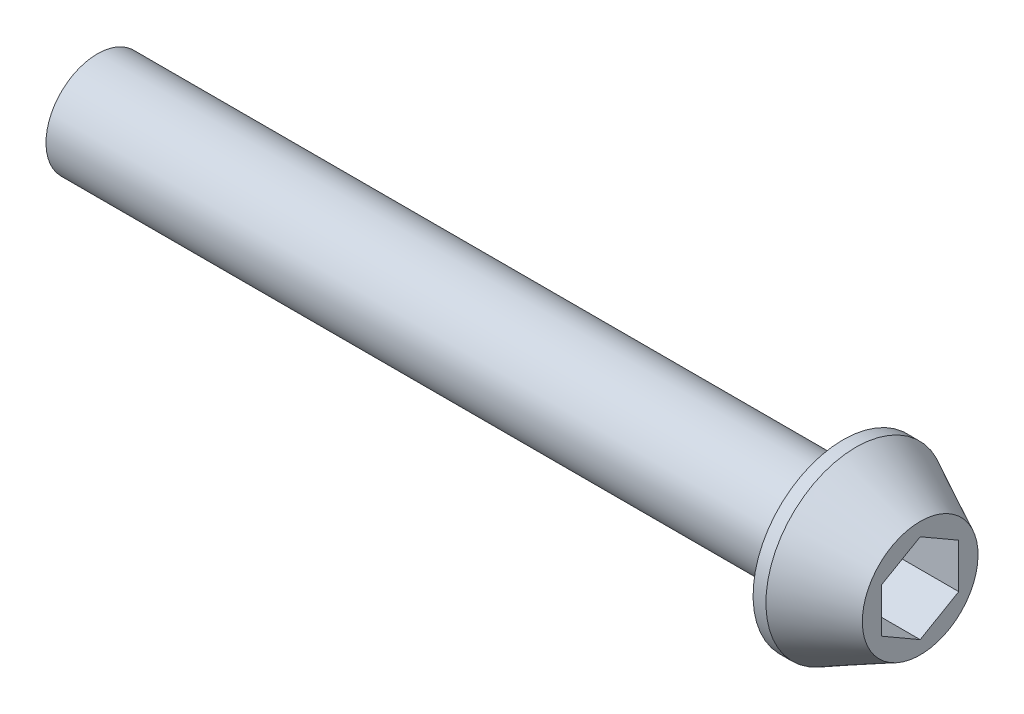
ISO-10303-21;
HEADER;
FILE_DESCRIPTION(('STEP AP214'),'2;1');
FILE_NAME('part.step','',(''),(''),'','','');
FILE_SCHEMA(('AUTOMOTIVE_DESIGN { 1 0 10303 214 1 1 1 1 }'));
ENDSEC;
DATA;
#1=APPLICATION_CONTEXT('core data for automotive mechanical design processes');
#2=APPLICATION_PROTOCOL_DEFINITION('international standard','automotive_design',2000,#1);
#3=PRODUCT_CONTEXT('',#1,'mechanical');
#4=PRODUCT('Part','Part','',(#3));
#5=PRODUCT_RELATED_PRODUCT_CATEGORY('part','',(#4));
#6=PRODUCT_DEFINITION_FORMATION('','',#4);
#7=PRODUCT_DEFINITION_CONTEXT('part definition',#1,'design');
#8=PRODUCT_DEFINITION('design','',#6,#7);
#9=PRODUCT_DEFINITION_SHAPE('','',#8);
#10=(LENGTH_UNIT() NAMED_UNIT(*) SI_UNIT(.MILLI.,.METRE.));
#11=(NAMED_UNIT(*) PLANE_ANGLE_UNIT() SI_UNIT($,.RADIAN.));
#12=(NAMED_UNIT(*) SI_UNIT($,.STERADIAN.) SOLID_ANGLE_UNIT());
#13=UNCERTAINTY_MEASURE_WITH_UNIT(LENGTH_MEASURE(1.E-05),#10,'distance_accuracy_value','');
#14=(GEOMETRIC_REPRESENTATION_CONTEXT(3) GLOBAL_UNCERTAINTY_ASSIGNED_CONTEXT((#13)) GLOBAL_UNIT_ASSIGNED_CONTEXT((#10,
#11,#12)) REPRESENTATION_CONTEXT('',''));
#15=CARTESIAN_POINT('',(0.,0.,0.));
#16=DIRECTION('',(0.,0.,1.));
#17=DIRECTION('',(1.,0.,0.));
#18=AXIS2_PLACEMENT_3D('',#15,#16,#17);
#19=CARTESIAN_POINT('',(-6.,3.,0.));
#20=DIRECTION('',(-1.,0.,0.));
#21=DIRECTION('',(0.,-1.,0.));
#22=AXIS2_PLACEMENT_3D('',#19,#20,#21);
#23=PLANE('',#22);
#24=CARTESIAN_POINT('',(-6.,0.,0.));
#25=DIRECTION('',(1.,0.,0.));
#26=DIRECTION('',(0.,1.,0.));
#27=AXIS2_PLACEMENT_3D('',#24,#25,#26);
#28=CIRCLE('',#27,3.);
#29=CARTESIAN_POINT('',(-6.,3.,0.));
#30=VERTEX_POINT('',#29);
#31=EDGE_CURVE('E133',#30,#30,#28,.T.);
#32=ORIENTED_EDGE('',*,*,#31,.F.);
#33=EDGE_LOOP('',(#32));
#34=FACE_BOUND('',#33,.T.);
#35=ADVANCED_FACE('F32',(#34),#23,.T.);
#36=CARTESIAN_POINT('',(0.,4.5,0.));
#37=DIRECTION('',(1.,0.,0.));
#38=DIRECTION('',(0.,1.,0.));
#39=AXIS2_PLACEMENT_3D('',#36,#37,#38);
#40=PLANE('',#39);
#41=DIRECTION('',(0.,0.5,0.866025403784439));
#42=VECTOR('',#41,1.);
#43=CARTESIAN_POINT('',(0.,1.73205080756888,-3.));
#44=LINE('',#43,#42);
#45=CARTESIAN_POINT('',(0.,1.73205080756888,-3.));
#46=VERTEX_POINT('',#45);
#47=CARTESIAN_POINT('',(0.,3.46410161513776,0.));
#48=VERTEX_POINT('',#47);
#49=EDGE_CURVE('E46',#46,#48,#44,.T.);
#50=ORIENTED_EDGE('',*,*,#49,.F.);
#51=DIRECTION('',(0.,1.,0.));
#52=VECTOR('',#51,1.);
#53=CARTESIAN_POINT('',(0.,-1.73205080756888,-3.));
#54=LINE('',#53,#52);
#55=CARTESIAN_POINT('',(0.,-1.73205080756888,-3.));
#56=VERTEX_POINT('',#55);
#57=EDGE_CURVE('E129',#56,#46,#54,.T.);
#58=ORIENTED_EDGE('',*,*,#57,.F.);
#59=DIRECTION('',(0.,0.5,-0.866025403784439));
#60=VECTOR('',#59,1.);
#61=CARTESIAN_POINT('',(0.,-3.46410161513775,0.));
#62=LINE('',#61,#60);
#63=CARTESIAN_POINT('',(0.,-3.46410161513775,0.));
#64=VERTEX_POINT('',#63);
#65=EDGE_CURVE('E127',#64,#56,#62,.T.);
#66=ORIENTED_EDGE('',*,*,#65,.F.);
#67=DIRECTION('',(0.,-0.5,-0.866025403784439));
#68=VECTOR('',#67,1.);
#69=CARTESIAN_POINT('',(0.,-1.73205080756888,3.));
#70=LINE('',#69,#68);
#71=CARTESIAN_POINT('',(0.,-1.73205080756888,3.));
#72=VERTEX_POINT('',#71);
#73=EDGE_CURVE('E94',#72,#64,#70,.T.);
#74=ORIENTED_EDGE('',*,*,#73,.F.);
#75=DIRECTION('',(0.,-1.,0.));
#76=VECTOR('',#75,1.);
#77=CARTESIAN_POINT('',(0.,1.73205080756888,3.));
#78=LINE('',#77,#76);
#79=CARTESIAN_POINT('',(0.,1.73205080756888,3.));
#80=VERTEX_POINT('',#79);
#81=EDGE_CURVE('E123',#80,#72,#78,.T.);
#82=ORIENTED_EDGE('',*,*,#81,.F.);
#83=DIRECTION('',(0.,-0.5,0.866025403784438));
#84=VECTOR('',#83,1.);
#85=CARTESIAN_POINT('',(0.,3.46410161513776,0.));
#86=LINE('',#85,#84);
#87=EDGE_CURVE('E120',#48,#80,#86,.T.);
#88=ORIENTED_EDGE('',*,*,#87,.F.);
#89=EDGE_LOOP('',(#50,#58,#66,#74,#82,#88));
#90=FACE_BOUND('',#89,.T.);
#91=CARTESIAN_POINT('',(0.,0.,0.));
#92=DIRECTION('',(1.,0.,0.));
#93=DIRECTION('',(0.,1.,0.));
#94=AXIS2_PLACEMENT_3D('',#91,#92,#93);
#95=CIRCLE('',#94,4.5);
#96=CARTESIAN_POINT('',(0.,4.5,0.));
#97=VERTEX_POINT('',#96);
#98=EDGE_CURVE('E11',#97,#97,#95,.T.);
#99=ORIENTED_EDGE('',*,*,#98,.T.);
#100=EDGE_LOOP('',(#99));
#101=FACE_BOUND('',#100,.T.);
#102=ADVANCED_FACE('F170',(#90,#101),#40,.T.);
#103=CARTESIAN_POINT('',(0.,0.,0.));
#104=DIRECTION('',(-1.,0.,0.));
#105=DIRECTION('',(0.,-1.,0.));
#106=AXIS2_PLACEMENT_3D('',#103,#104,#105);
#107=CONICAL_SURFACE('',#106,4.5,0.463647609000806);
#108=CARTESIAN_POINT('',(-5.,0.,0.));
#109=DIRECTION('',(1.,0.,0.));
#110=DIRECTION('',(0.,1.,0.));
#111=AXIS2_PLACEMENT_3D('',#108,#109,#110);
#112=CIRCLE('',#111,7.);
#113=CARTESIAN_POINT('',(-5.,7.,0.));
#114=VERTEX_POINT('',#113);
#115=EDGE_CURVE('E39',#114,#114,#112,.T.);
#116=ORIENTED_EDGE('',*,*,#115,.T.);
#117=EDGE_LOOP('',(#116));
#118=FACE_BOUND('',#117,.T.);
#119=ORIENTED_EDGE('',*,*,#98,.F.);
#120=EDGE_LOOP('',(#119));
#121=FACE_BOUND('',#120,.T.);
#122=ADVANCED_FACE('F155',(#118,#121),#107,.T.);
#123=CARTESIAN_POINT('',(0.,0.,0.));
#124=DIRECTION('',(1.,0.,0.));
#125=DIRECTION('',(0.,1.,0.));
#126=AXIS2_PLACEMENT_3D('',#123,#124,#125);
#127=CYLINDRICAL_SURFACE('',#126,7.);
#128=CARTESIAN_POINT('',(-6.,0.,0.));
#129=DIRECTION('',(1.,0.,0.));
#130=DIRECTION('',(0.,1.,0.));
#131=AXIS2_PLACEMENT_3D('',#128,#129,#130);
#132=CIRCLE('',#131,7.);
#133=CARTESIAN_POINT('',(-6.,7.,0.));
#134=VERTEX_POINT('',#133);
#135=EDGE_CURVE('E150',#134,#134,#132,.T.);
#136=ORIENTED_EDGE('',*,*,#135,.T.);
#137=EDGE_LOOP('',(#136));
#138=FACE_BOUND('',#137,.T.);
#139=ORIENTED_EDGE('',*,*,#115,.F.);
#140=EDGE_LOOP('',(#139));
#141=FACE_BOUND('',#140,.T.);
#142=ADVANCED_FACE('F158',(#138,#141),#127,.T.);
#143=CARTESIAN_POINT('',(-6.,3.99999999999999,0.));
#144=DIRECTION('',(-1.,0.,0.));
#145=DIRECTION('',(0.,-1.,0.));
#146=AXIS2_PLACEMENT_3D('',#143,#144,#145);
#147=PLANE('',#146);
#148=CARTESIAN_POINT('',(-6.,0.,0.));
#149=DIRECTION('',(1.,0.,0.));
#150=DIRECTION('',(0.,1.,0.));
#151=AXIS2_PLACEMENT_3D('',#148,#149,#150);
#152=CIRCLE('',#151,3.99999999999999);
#153=CARTESIAN_POINT('',(-6.,3.99999999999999,0.));
#154=VERTEX_POINT('',#153);
#155=EDGE_CURVE('E147',#154,#154,#152,.T.);
#156=ORIENTED_EDGE('',*,*,#155,.T.);
#157=EDGE_LOOP('',(#156));
#158=FACE_BOUND('',#157,.T.);
#159=ORIENTED_EDGE('',*,*,#135,.F.);
#160=EDGE_LOOP('',(#159));
#161=FACE_BOUND('',#160,.T.);
#162=ADVANCED_FACE('F160',(#158,#161),#147,.T.);
#163=CARTESIAN_POINT('',(0.,0.,0.));
#164=DIRECTION('',(1.,0.,0.));
#165=DIRECTION('',(0.,1.,0.));
#166=AXIS2_PLACEMENT_3D('',#163,#164,#165);
#167=CYLINDRICAL_SURFACE('',#166,4.);
#168=CARTESIAN_POINT('',(-64.,0.,0.));
#169=DIRECTION('',(1.,0.,0.));
#170=DIRECTION('',(0.,1.,0.));
#171=AXIS2_PLACEMENT_3D('',#168,#169,#170);
#172=CIRCLE('',#171,4.);
#173=CARTESIAN_POINT('',(-64.,3.99999999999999,0.));
#174=VERTEX_POINT('',#173);
#175=EDGE_CURVE('E144',#174,#174,#172,.T.);
#176=ORIENTED_EDGE('',*,*,#175,.T.);
#177=EDGE_LOOP('',(#176));
#178=FACE_BOUND('',#177,.T.);
#179=ORIENTED_EDGE('',*,*,#155,.F.);
#180=EDGE_LOOP('',(#179));
#181=FACE_BOUND('',#180,.T.);
#182=ADVANCED_FACE('F167',(#178,#181),#167,.T.);
#183=CARTESIAN_POINT('',(-64.,3.99999999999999,0.));
#184=DIRECTION('',(-1.,0.,0.));
#185=DIRECTION('',(0.,-1.,0.));
#186=AXIS2_PLACEMENT_3D('',#183,#184,#185);
#187=PLANE('',#186);
#188=CARTESIAN_POINT('',(-64.,0.,0.));
#189=DIRECTION('',(1.,0.,0.));
#190=DIRECTION('',(0.,1.,0.));
#191=AXIS2_PLACEMENT_3D('',#188,#189,#190);
#192=CIRCLE('',#191,3.);
#193=CARTESIAN_POINT('',(-64.,2.99999999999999,0.));
#194=VERTEX_POINT('',#193);
#195=EDGE_CURVE('E141',#194,#194,#192,.T.);
#196=ORIENTED_EDGE('',*,*,#195,.T.);
#197=EDGE_LOOP('',(#196));
#198=FACE_BOUND('',#197,.T.);
#199=ORIENTED_EDGE('',*,*,#175,.F.);
#200=EDGE_LOOP('',(#199));
#201=FACE_BOUND('',#200,.T.);
#202=ADVANCED_FACE('F184',(#198,#201),#187,.T.);
#203=CARTESIAN_POINT('',(0.,0.,0.));
#204=DIRECTION('',(1.,0.,0.));
#205=DIRECTION('',(0.,1.,0.));
#206=AXIS2_PLACEMENT_3D('',#203,#204,#205);
#207=CYLINDRICAL_SURFACE('',#206,3.);
#208=ORIENTED_EDGE('',*,*,#31,.T.);
#209=EDGE_LOOP('',(#208));
#210=FACE_BOUND('',#209,.T.);
#211=ORIENTED_EDGE('',*,*,#195,.F.);
#212=EDGE_LOOP('',(#211));
#213=FACE_BOUND('',#212,.T.);
#214=ADVANCED_FACE('F180',(#210,#213),#207,.F.);
#215=CARTESIAN_POINT('',(-5.,1.73205080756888,-3.));
#216=DIRECTION('',(0.,0.866025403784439,-0.5));
#217=DIRECTION('',(0.,0.5,0.866025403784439));
#218=AXIS2_PLACEMENT_3D('',#215,#216,#217);
#219=PLANE('',#218);
#220=ORIENTED_EDGE('',*,*,#49,.T.);
#221=DIRECTION('',(1.,0.,0.));
#222=VECTOR('',#221,1.);
#223=CARTESIAN_POINT('',(-5.,3.46410161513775,0.));
#224=LINE('',#223,#222);
#225=CARTESIAN_POINT('',(-5.,3.46410161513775,0.));
#226=VERTEX_POINT('',#225);
#227=EDGE_CURVE('E76',#226,#48,#224,.T.);
#228=ORIENTED_EDGE('',*,*,#227,.F.);
#229=DIRECTION('',(0.,0.5,0.866025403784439));
#230=VECTOR('',#229,1.);
#231=CARTESIAN_POINT('',(-5.,1.73205080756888,-3.));
#232=LINE('',#231,#230);
#233=CARTESIAN_POINT('',(-5.,1.73205080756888,-3.));
#234=VERTEX_POINT('',#233);
#235=EDGE_CURVE('E131',#234,#226,#232,.T.);
#236=ORIENTED_EDGE('',*,*,#235,.F.);
#237=DIRECTION('',(1.,0.,0.));
#238=VECTOR('',#237,1.);
#239=CARTESIAN_POINT('',(-5.,1.73205080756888,-3.));
#240=LINE('',#239,#238);
#241=EDGE_CURVE('E54',#234,#46,#240,.T.);
#242=ORIENTED_EDGE('',*,*,#241,.T.);
#243=EDGE_LOOP('',(#220,#228,#236,#242));
#244=FACE_BOUND('',#243,.T.);
#245=ADVANCED_FACE('F183',(#244),#219,.F.);
#246=CARTESIAN_POINT('',(-5.,-1.73205080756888,-3.));
#247=DIRECTION('',(0.,0.,-1.));
#248=DIRECTION('',(0.,1.,0.));
#249=AXIS2_PLACEMENT_3D('',#246,#247,#248);
#250=PLANE('',#249);
#251=ORIENTED_EDGE('',*,*,#57,.T.);
#252=ORIENTED_EDGE('',*,*,#241,.F.);
#253=DIRECTION('',(0.,1.,0.));
#254=VECTOR('',#253,1.);
#255=CARTESIAN_POINT('',(-5.,-1.73205080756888,-3.));
#256=LINE('',#255,#254);
#257=CARTESIAN_POINT('',(-5.,-1.73205080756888,-3.));
#258=VERTEX_POINT('',#257);
#259=EDGE_CURVE('E106',#258,#234,#256,.T.);
#260=ORIENTED_EDGE('',*,*,#259,.F.);
#261=DIRECTION('',(1.,0.,0.));
#262=VECTOR('',#261,1.);
#263=CARTESIAN_POINT('',(-5.,-1.73205080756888,-3.));
#264=LINE('',#263,#262);
#265=EDGE_CURVE('E98',#258,#56,#264,.T.);
#266=ORIENTED_EDGE('',*,*,#265,.T.);
#267=EDGE_LOOP('',(#251,#252,#260,#266));
#268=FACE_BOUND('',#267,.T.);
#269=ADVANCED_FACE('F204',(#268),#250,.F.);
#270=CARTESIAN_POINT('',(-5.,-3.46410161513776,0.));
#271=DIRECTION('',(0.,-0.866025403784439,-0.5));
#272=DIRECTION('',(0.,0.5,-0.866025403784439));
#273=AXIS2_PLACEMENT_3D('',#270,#271,#272);
#274=PLANE('',#273);
#275=ORIENTED_EDGE('',*,*,#65,.T.);
#276=ORIENTED_EDGE('',*,*,#265,.F.);
#277=DIRECTION('',(0.,0.5,-0.866025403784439));
#278=VECTOR('',#277,1.);
#279=CARTESIAN_POINT('',(-5.,-3.46410161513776,0.));
#280=LINE('',#279,#278);
#281=CARTESIAN_POINT('',(-5.,-3.46410161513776,0.));
#282=VERTEX_POINT('',#281);
#283=EDGE_CURVE('E102',#282,#258,#280,.T.);
#284=ORIENTED_EDGE('',*,*,#283,.F.);
#285=DIRECTION('',(1.,0.,0.));
#286=VECTOR('',#285,1.);
#287=CARTESIAN_POINT('',(-5.,-3.46410161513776,0.));
#288=LINE('',#287,#286);
#289=EDGE_CURVE('E87',#282,#64,#288,.T.);
#290=ORIENTED_EDGE('',*,*,#289,.T.);
#291=EDGE_LOOP('',(#275,#276,#284,#290));
#292=FACE_BOUND('',#291,.T.);
#293=ADVANCED_FACE('F103',(#292),#274,.F.);
#294=CARTESIAN_POINT('',(-5.,-1.73205080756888,3.));
#295=DIRECTION('',(0.,-0.866025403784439,0.5));
#296=DIRECTION('',(0.,-0.5,-0.866025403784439));
#297=AXIS2_PLACEMENT_3D('',#294,#295,#296);
#298=PLANE('',#297);
#299=ORIENTED_EDGE('',*,*,#73,.T.);
#300=ORIENTED_EDGE('',*,*,#289,.F.);
#301=DIRECTION('',(0.,-0.5,-0.866025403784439));
#302=VECTOR('',#301,1.);
#303=CARTESIAN_POINT('',(-5.,-1.73205080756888,3.));
#304=LINE('',#303,#302);
#305=CARTESIAN_POINT('',(-5.,-1.73205080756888,3.));
#306=VERTEX_POINT('',#305);
#307=EDGE_CURVE('E91',#306,#282,#304,.T.);
#308=ORIENTED_EDGE('',*,*,#307,.F.);
#309=DIRECTION('',(1.,0.,0.));
#310=VECTOR('',#309,1.);
#311=CARTESIAN_POINT('',(-5.,-1.73205080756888,3.));
#312=LINE('',#311,#310);
#313=EDGE_CURVE('E99',#306,#72,#312,.T.);
#314=ORIENTED_EDGE('',*,*,#313,.T.);
#315=EDGE_LOOP('',(#299,#300,#308,#314));
#316=FACE_BOUND('',#315,.T.);
#317=ADVANCED_FACE('F89',(#316),#298,.F.);
#318=CARTESIAN_POINT('',(-5.,1.73205080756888,3.));
#319=DIRECTION('',(0.,0.,1.));
#320=DIRECTION('',(0.,-1.,0.));
#321=AXIS2_PLACEMENT_3D('',#318,#319,#320);
#322=PLANE('',#321);
#323=ORIENTED_EDGE('',*,*,#81,.T.);
#324=ORIENTED_EDGE('',*,*,#313,.F.);
#325=DIRECTION('',(0.,-1.,0.));
#326=VECTOR('',#325,1.);
#327=CARTESIAN_POINT('',(-5.,1.73205080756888,3.));
#328=LINE('',#327,#326);
#329=CARTESIAN_POINT('',(-5.,1.73205080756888,3.));
#330=VERTEX_POINT('',#329);
#331=EDGE_CURVE('E112',#330,#306,#328,.T.);
#332=ORIENTED_EDGE('',*,*,#331,.F.);
#333=DIRECTION('',(1.,0.,0.));
#334=VECTOR('',#333,1.);
#335=CARTESIAN_POINT('',(-5.,1.73205080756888,3.));
#336=LINE('',#335,#334);
#337=EDGE_CURVE('E136',#330,#80,#336,.T.);
#338=ORIENTED_EDGE('',*,*,#337,.T.);
#339=EDGE_LOOP('',(#323,#324,#332,#338));
#340=FACE_BOUND('',#339,.T.);
#341=ADVANCED_FACE('F208',(#340),#322,.F.);
#342=CARTESIAN_POINT('',(-5.,3.46410161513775,0.));
#343=DIRECTION('',(0.,0.866025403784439,0.5));
#344=DIRECTION('',(0.,-0.5,0.866025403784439));
#345=AXIS2_PLACEMENT_3D('',#342,#343,#344);
#346=PLANE('',#345);
#347=ORIENTED_EDGE('',*,*,#87,.T.);
#348=ORIENTED_EDGE('',*,*,#337,.F.);
#349=DIRECTION('',(0.,-0.5,0.866025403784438));
#350=VECTOR('',#349,1.);
#351=CARTESIAN_POINT('',(-5.,3.46410161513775,0.));
#352=LINE('',#351,#350);
#353=EDGE_CURVE('E114',#226,#330,#352,.T.);
#354=ORIENTED_EDGE('',*,*,#353,.F.);
#355=ORIENTED_EDGE('',*,*,#227,.T.);
#356=EDGE_LOOP('',(#347,#348,#354,#355));
#357=FACE_BOUND('',#356,.T.);
#358=ADVANCED_FACE('F205',(#357),#346,.F.);
#359=CARTESIAN_POINT('',(-5.,0.,0.));
#360=DIRECTION('',(1.,0.,0.));
#361=DIRECTION('',(0.,1.,0.));
#362=AXIS2_PLACEMENT_3D('',#359,#360,#361);
#363=PLANE('',#362);
#364=ORIENTED_EDGE('',*,*,#235,.T.);
#365=ORIENTED_EDGE('',*,*,#353,.T.);
#366=ORIENTED_EDGE('',*,*,#331,.T.);
#367=ORIENTED_EDGE('',*,*,#307,.T.);
#368=ORIENTED_EDGE('',*,*,#283,.T.);
#369=ORIENTED_EDGE('',*,*,#259,.T.);
#370=EDGE_LOOP('',(#364,#365,#366,#367,#368,#369));
#371=FACE_BOUND('',#370,.T.);
#372=ADVANCED_FACE('F109',(#371),#363,.T.);
#373=CLOSED_SHELL('',(#35,#102,#122,#142,#162,#182,#202,#214,#245,#269,#293,#317,#341,#358,#372));
#374=MANIFOLD_SOLID_BREP('B2',#373);
#375=ADVANCED_BREP_SHAPE_REPRESENTATION('',(#18,#374),#14);
#376=SHAPE_DEFINITION_REPRESENTATION(#9,#375);
ENDSEC;
END-ISO-10303-21;
